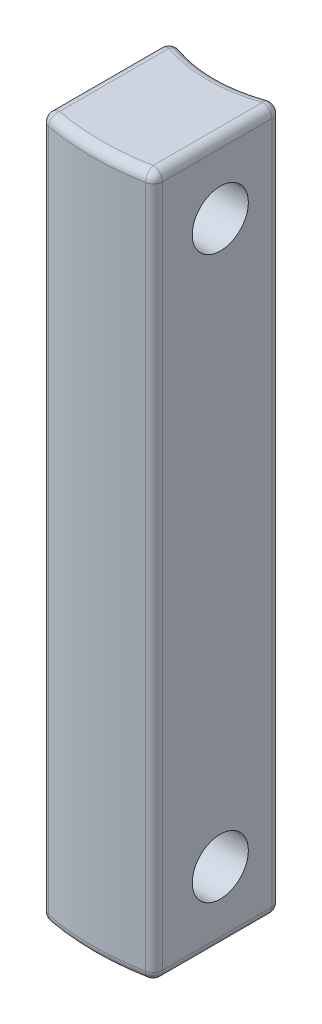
from build123d import *

# Parameters (mm, degrees)
EXTRUDE_1_DEPTH          = 37.5
CUT_EXTRUDE_1_DEPTH      = 40.622583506
CUT_EXTRUDE_1_DEPTH_BACK = 40.622583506
SKETCH_2_R               = 3
FILLET_1_R               = 1


with BuildPart() as part:
    # Sketch 1 → Extrude 1 (new, symmetric)
    with BuildSketch(Plane(origin=(0, 0, 0), x_dir=(1, 0, 0), z_dir=(0, 1, 0))):
        with BuildLine():
            Line((-1.744741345, 7), (-1.744741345, -7))
            ThreePointArc((-1.744741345, -7), (4.255258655, -7.650411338), (10.255258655, -7))
            Line((10.255258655, -7), (10.255258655, 7))
            ThreePointArc((10.255258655, 7), (4.255258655, 5.649110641), (-1.744741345, 7))
        make_face()
    extrude(amount=EXTRUDE_1_DEPTH, both=True)

    # Sketch 2 → Cut-Extrude 1 (cut, two sides: drawn at the far end of the back side and taken through both)
    with BuildSketch(Plane(origin=(0, 0, 0), x_dir=(0, 0, -1), z_dir=(1, 0, 0)).offset(-CUT_EXTRUDE_1_DEPTH_BACK)):
        with Locations((0, 30)):
            Circle(SKETCH_2_R)
        with Locations((0, -30)):
            Circle(SKETCH_2_R)
    extrude(amount=CUT_EXTRUDE_1_DEPTH + CUT_EXTRUDE_1_DEPTH_BACK, mode=Mode.SUBTRACT)

    # Fillet 1
    fillet_1_edges = [part.edges().sort_by_distance(p)[0] for p in [
        (4.255258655, 37.5, 7.650411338),
        (10.255258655, 37.5, 0),
        (4.255258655, 37.5, -5.649110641),
        (10.255258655, -37.5, 0),
        (4.255258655, -37.5, 7.650411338),
        (-1.744741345, -37.5, 0),
        (4.255258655, -37.5, -5.649110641),
        (10.255258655, 0, -7),
        (10.255258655, 0, 7),
        (-1.744741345, 0, 7),
        (-1.744741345, 0, -7),
        (-1.744741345, 37.5, 0),
    ]]
    fillet(fillet_1_edges, radius=FILLET_1_R)


solid = part.part
